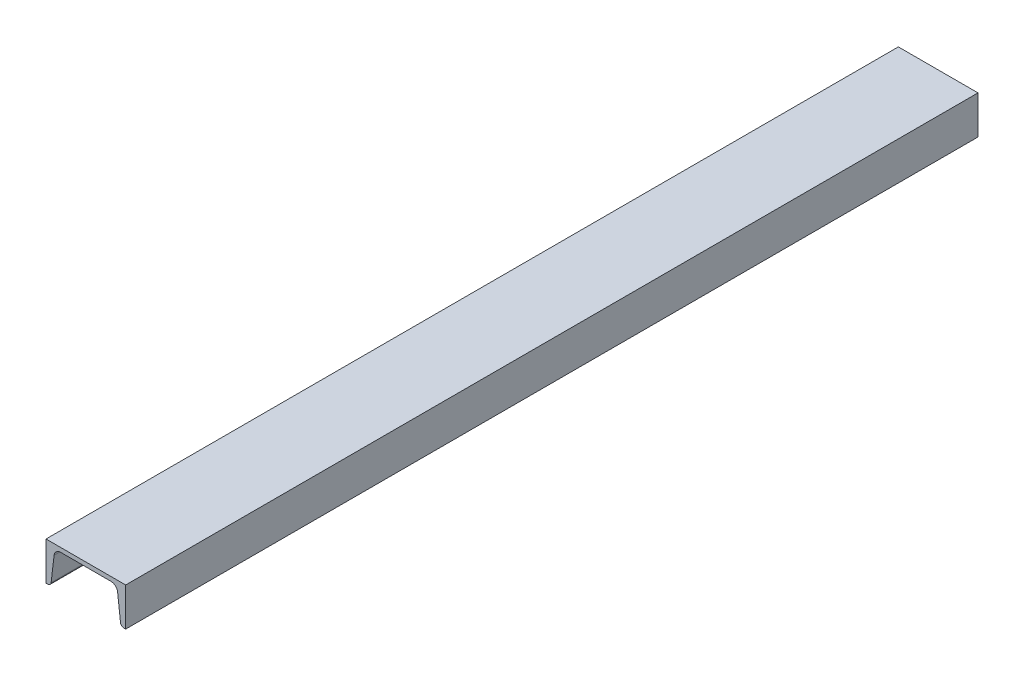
ISO-10303-21;
HEADER;
FILE_DESCRIPTION(('STEP AP214'),'2;1');
FILE_NAME('part.step','',(''),(''),'','','');
FILE_SCHEMA(('AUTOMOTIVE_DESIGN { 1 0 10303 214 1 1 1 1 }'));
ENDSEC;
DATA;
#1=APPLICATION_CONTEXT('core data for automotive mechanical design processes');
#2=APPLICATION_PROTOCOL_DEFINITION('international standard','automotive_design',2000,#1);
#3=PRODUCT_CONTEXT('',#1,'mechanical');
#4=PRODUCT('Part','Part','',(#3));
#5=PRODUCT_RELATED_PRODUCT_CATEGORY('part','',(#4));
#6=PRODUCT_DEFINITION_FORMATION('','',#4);
#7=PRODUCT_DEFINITION_CONTEXT('part definition',#1,'design');
#8=PRODUCT_DEFINITION('design','',#6,#7);
#9=PRODUCT_DEFINITION_SHAPE('','',#8);
#10=(LENGTH_UNIT() NAMED_UNIT(*) SI_UNIT(.MILLI.,.METRE.));
#11=(NAMED_UNIT(*) PLANE_ANGLE_UNIT() SI_UNIT($,.RADIAN.));
#12=(NAMED_UNIT(*) SI_UNIT($,.STERADIAN.) SOLID_ANGLE_UNIT());
#13=UNCERTAINTY_MEASURE_WITH_UNIT(LENGTH_MEASURE(1.E-05),#10,'distance_accuracy_value','');
#14=(GEOMETRIC_REPRESENTATION_CONTEXT(3) GLOBAL_UNCERTAINTY_ASSIGNED_CONTEXT((#13)) GLOBAL_UNIT_ASSIGNED_CONTEXT((#10,
#11,#12)) REPRESENTATION_CONTEXT('',''));
#15=CARTESIAN_POINT('',(0.,0.,0.));
#16=DIRECTION('',(0.,0.,1.));
#17=DIRECTION('',(1.,0.,0.));
#18=AXIS2_PLACEMENT_3D('',#15,#16,#17);
#19=CARTESIAN_POINT('',(-50.,-48.,1070.));
#20=DIRECTION('',(1.,0.,0.));
#21=DIRECTION('',(0.,0.,-1.));
#22=AXIS2_PLACEMENT_3D('',#19,#20,#21);
#23=PLANE('',#22);
#24=DIRECTION('',(0.,-1.,0.));
#25=VECTOR('',#24,1.);
#26=CARTESIAN_POINT('',(-50.,-48.,0.));
#27=LINE('',#26,#25);
#28=CARTESIAN_POINT('',(-50.,0.,0.));
#29=VERTEX_POINT('',#28);
#30=CARTESIAN_POINT('',(-50.,-48.,0.));
#31=VERTEX_POINT('',#30);
#32=EDGE_CURVE('E133',#29,#31,#27,.T.);
#33=ORIENTED_EDGE('',*,*,#32,.T.);
#34=DIRECTION('',(0.,0.,-1.));
#35=VECTOR('',#34,1.);
#36=CARTESIAN_POINT('',(-50.,-48.,1070.));
#37=LINE('',#36,#35);
#38=CARTESIAN_POINT('',(-50.,-48.,1070.));
#39=VERTEX_POINT('',#38);
#40=EDGE_CURVE('E11',#39,#31,#37,.T.);
#41=ORIENTED_EDGE('',*,*,#40,.F.);
#42=DIRECTION('',(0.,-1.,0.));
#43=VECTOR('',#42,1.);
#44=CARTESIAN_POINT('',(-50.,-48.,1070.));
#45=LINE('',#44,#43);
#46=CARTESIAN_POINT('',(-50.,0.,1070.));
#47=VERTEX_POINT('',#46);
#48=EDGE_CURVE('E168',#47,#39,#45,.T.);
#49=ORIENTED_EDGE('',*,*,#48,.F.);
#50=DIRECTION('',(0.,0.,-1.));
#51=VECTOR('',#50,1.);
#52=CARTESIAN_POINT('',(-50.,0.,1070.));
#53=LINE('',#52,#51);
#54=EDGE_CURVE('E146',#47,#29,#53,.T.);
#55=ORIENTED_EDGE('',*,*,#54,.T.);
#56=EDGE_LOOP('',(#33,#41,#49,#55));
#57=FACE_BOUND('',#56,.T.);
#58=ADVANCED_FACE('F41',(#57),#23,.F.);
#59=CARTESIAN_POINT('',(-47.8258664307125,-48.,1070.));
#60=DIRECTION('',(0.,1.,0.));
#61=DIRECTION('',(0.,0.,1.));
#62=AXIS2_PLACEMENT_3D('',#59,#60,#61);
#63=PLANE('',#62);
#64=DIRECTION('',(1.,0.,0.));
#65=VECTOR('',#64,1.);
#66=CARTESIAN_POINT('',(-47.8258664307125,-48.,0.));
#67=LINE('',#66,#65);
#68=CARTESIAN_POINT('',(-47.8258664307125,-48.,0.));
#69=VERTEX_POINT('',#68);
#70=EDGE_CURVE('E129',#31,#69,#67,.T.);
#71=ORIENTED_EDGE('',*,*,#70,.T.);
#72=DIRECTION('',(0.,0.,-1.));
#73=VECTOR('',#72,1.);
#74=CARTESIAN_POINT('',(-47.8258664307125,-48.,1070.));
#75=LINE('',#74,#73);
#76=CARTESIAN_POINT('',(-47.8258664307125,-48.,1070.));
#77=VERTEX_POINT('',#76);
#78=EDGE_CURVE('E48',#77,#69,#75,.T.);
#79=ORIENTED_EDGE('',*,*,#78,.F.);
#80=DIRECTION('',(1.,0.,0.));
#81=VECTOR('',#80,1.);
#82=CARTESIAN_POINT('',(-47.8258664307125,-48.,1070.));
#83=LINE('',#82,#81);
#84=EDGE_CURVE('E142',#39,#77,#83,.T.);
#85=ORIENTED_EDGE('',*,*,#84,.F.);
#86=ORIENTED_EDGE('',*,*,#40,.T.);
#87=EDGE_LOOP('',(#71,#79,#85,#86));
#88=FACE_BOUND('',#87,.T.);
#89=ADVANCED_FACE('F141',(#88),#63,.F.);
#90=CARTESIAN_POINT('',(-47.8258664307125,-43.7,1070.));
#91=DIRECTION('',(0.,0.,-1.));
#92=DIRECTION('',(-1.,0.,0.));
#93=AXIS2_PLACEMENT_3D('',#90,#91,#92);
#94=CYLINDRICAL_SURFACE('',#93,4.3);
#95=CARTESIAN_POINT('',(-47.8258664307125,-43.7,0.));
#96=DIRECTION('',(0.,0.,1.));
#97=DIRECTION('',(-1.,0.,0.));
#98=AXIS2_PLACEMENT_3D('',#95,#96,#97);
#99=CIRCLE('',#98,4.3);
#100=CARTESIAN_POINT('',(-43.5550463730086,-44.2000960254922,0.));
#101=VERTEX_POINT('',#100);
#102=EDGE_CURVE('E135',#69,#101,#99,.T.);
#103=ORIENTED_EDGE('',*,*,#102,.T.);
#104=DIRECTION('',(0.,0.,-1.));
#105=VECTOR('',#104,1.);
#106=CARTESIAN_POINT('',(-43.5550463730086,-44.2000960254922,1070.));
#107=LINE('',#106,#105);
#108=CARTESIAN_POINT('',(-43.5550463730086,-44.2000960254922,1070.));
#109=VERTEX_POINT('',#108);
#110=EDGE_CURVE('E214',#109,#101,#107,.T.);
#111=ORIENTED_EDGE('',*,*,#110,.F.);
#112=CARTESIAN_POINT('',(-47.8258664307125,-43.7,1070.));
#113=DIRECTION('',(0.,0.,1.));
#114=DIRECTION('',(-1.,0.,0.));
#115=AXIS2_PLACEMENT_3D('',#112,#113,#114);
#116=CIRCLE('',#115,4.3);
#117=EDGE_CURVE('E171',#77,#109,#116,.T.);
#118=ORIENTED_EDGE('',*,*,#117,.F.);
#119=ORIENTED_EDGE('',*,*,#78,.T.);
#120=EDGE_LOOP('',(#103,#111,#118,#119));
#121=FACE_BOUND('',#120,.T.);
#122=ADVANCED_FACE('F218',(#121),#94,.T.);
#123=CARTESIAN_POINT('',(-39.8795594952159,-12.8114380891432,1070.));
#124=DIRECTION('',(-0.993213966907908,0.116301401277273,0.));
#125=DIRECTION('',(-0.116301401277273,-0.993213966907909,0.));
#126=AXIS2_PLACEMENT_3D('',#123,#124,#125);
#127=PLANE('',#126);
#128=DIRECTION('',(0.116301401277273,0.993213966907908,0.));
#129=VECTOR('',#128,1.);
#130=CARTESIAN_POINT('',(-39.8795594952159,-12.8114380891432,0.));
#131=LINE('',#130,#129);
#132=CARTESIAN_POINT('',(-39.8795594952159,-12.8114380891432,0.));
#133=VERTEX_POINT('',#132);
#134=EDGE_CURVE('E150',#101,#133,#131,.T.);
#135=ORIENTED_EDGE('',*,*,#134,.T.);
#136=DIRECTION('',(0.,0.,-1.));
#137=VECTOR('',#136,1.);
#138=CARTESIAN_POINT('',(-39.8795594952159,-12.8114380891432,1070.));
#139=LINE('',#138,#137);
#140=CARTESIAN_POINT('',(-39.8795594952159,-12.8114380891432,1070.));
#141=VERTEX_POINT('',#140);
#142=EDGE_CURVE('E211',#141,#133,#139,.T.);
#143=ORIENTED_EDGE('',*,*,#142,.F.);
#144=DIRECTION('',(0.116301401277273,0.993213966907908,0.));
#145=VECTOR('',#144,1.);
#146=CARTESIAN_POINT('',(-39.8795594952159,-12.8114380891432,1070.));
#147=LINE('',#146,#145);
#148=EDGE_CURVE('E173',#109,#141,#147,.T.);
#149=ORIENTED_EDGE('',*,*,#148,.F.);
#150=ORIENTED_EDGE('',*,*,#110,.T.);
#151=EDGE_LOOP('',(#135,#143,#149,#150));
#152=FACE_BOUND('',#151,.T.);
#153=ADVANCED_FACE('F226',(#152),#127,.F.);
#154=CARTESIAN_POINT('',(-31.4372407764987,-13.8,1070.));
#155=DIRECTION('',(0.,0.,-1.));
#156=DIRECTION('',(-1.,0.,0.));
#157=AXIS2_PLACEMENT_3D('',#154,#155,#156);
#158=CYLINDRICAL_SURFACE('',#157,8.5);
#159=CARTESIAN_POINT('',(-31.4372407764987,-13.8,0.));
#160=DIRECTION('',(0.,0.,-1.));
#161=DIRECTION('',(1.,0.,0.));
#162=AXIS2_PLACEMENT_3D('',#159,#160,#161);
#163=CIRCLE('',#162,8.5);
#164=CARTESIAN_POINT('',(-31.4372407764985,-5.29999999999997,0.));
#165=VERTEX_POINT('',#164);
#166=EDGE_CURVE('E152',#133,#165,#163,.T.);
#167=ORIENTED_EDGE('',*,*,#166,.T.);
#168=DIRECTION('',(0.,0.,-1.));
#169=VECTOR('',#168,1.);
#170=CARTESIAN_POINT('',(-31.4372407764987,-5.29999999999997,1070.));
#171=LINE('',#170,#169);
#172=CARTESIAN_POINT('',(-31.4372407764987,-5.29999999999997,1070.));
#173=VERTEX_POINT('',#172);
#174=EDGE_CURVE('E208',#173,#165,#171,.T.);
#175=ORIENTED_EDGE('',*,*,#174,.F.);
#176=CARTESIAN_POINT('',(-31.4372407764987,-13.8,1070.));
#177=DIRECTION('',(0.,0.,-1.));
#178=DIRECTION('',(1.,0.,0.));
#179=AXIS2_PLACEMENT_3D('',#176,#177,#178);
#180=CIRCLE('',#179,8.5);
#181=EDGE_CURVE('E175',#141,#173,#180,.T.);
#182=ORIENTED_EDGE('',*,*,#181,.F.);
#183=ORIENTED_EDGE('',*,*,#142,.T.);
#184=EDGE_LOOP('',(#167,#175,#182,#183));
#185=FACE_BOUND('',#184,.T.);
#186=ADVANCED_FACE('F229',(#185),#158,.F.);
#187=CARTESIAN_POINT('',(31.4372407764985,-5.29999999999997,1070.));
#188=DIRECTION('',(0.,1.,0.));
#189=DIRECTION('',(-1.,0.,0.));
#190=AXIS2_PLACEMENT_3D('',#187,#188,#189);
#191=PLANE('',#190);
#192=DIRECTION('',(1.,0.,0.));
#193=VECTOR('',#192,1.);
#194=CARTESIAN_POINT('',(31.4372407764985,-5.3,0.));
#195=LINE('',#194,#193);
#196=CARTESIAN_POINT('',(31.4372407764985,-5.3,0.));
#197=VERTEX_POINT('',#196);
#198=EDGE_CURVE('E154',#165,#197,#195,.T.);
#199=ORIENTED_EDGE('',*,*,#198,.T.);
#200=DIRECTION('',(0.,0.,-1.));
#201=VECTOR('',#200,1.);
#202=CARTESIAN_POINT('',(31.4372407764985,-5.29999999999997,1070.));
#203=LINE('',#202,#201);
#204=CARTESIAN_POINT('',(31.4372407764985,-5.29999999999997,1070.));
#205=VERTEX_POINT('',#204);
#206=EDGE_CURVE('E205',#205,#197,#203,.T.);
#207=ORIENTED_EDGE('',*,*,#206,.F.);
#208=DIRECTION('',(1.,0.,0.));
#209=VECTOR('',#208,1.);
#210=CARTESIAN_POINT('',(31.4372407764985,-5.29999999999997,1070.));
#211=LINE('',#210,#209);
#212=EDGE_CURVE('E177',#173,#205,#211,.T.);
#213=ORIENTED_EDGE('',*,*,#212,.F.);
#214=ORIENTED_EDGE('',*,*,#174,.T.);
#215=EDGE_LOOP('',(#199,#207,#213,#214));
#216=FACE_BOUND('',#215,.T.);
#217=ADVANCED_FACE('F234',(#216),#191,.F.);
#218=CARTESIAN_POINT('',(31.4372407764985,-13.8,1070.));
#219=DIRECTION('',(0.,0.,-1.));
#220=DIRECTION('',(-1.,0.,0.));
#221=AXIS2_PLACEMENT_3D('',#218,#219,#220);
#222=CYLINDRICAL_SURFACE('',#221,8.5);
#223=CARTESIAN_POINT('',(31.4372407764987,-13.8,0.));
#224=DIRECTION('',(0.,0.,-1.));
#225=DIRECTION('',(1.,0.,0.));
#226=AXIS2_PLACEMENT_3D('',#223,#224,#225);
#227=CIRCLE('',#226,8.5);
#228=CARTESIAN_POINT('',(39.8795594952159,-12.8114380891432,0.));
#229=VERTEX_POINT('',#228);
#230=EDGE_CURVE('E156',#197,#229,#227,.T.);
#231=ORIENTED_EDGE('',*,*,#230,.T.);
#232=DIRECTION('',(0.,0.,-1.));
#233=VECTOR('',#232,1.);
#234=CARTESIAN_POINT('',(39.8795594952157,-12.8114380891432,1070.));
#235=LINE('',#234,#233);
#236=CARTESIAN_POINT('',(39.8795594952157,-12.8114380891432,1070.));
#237=VERTEX_POINT('',#236);
#238=EDGE_CURVE('E202',#237,#229,#235,.T.);
#239=ORIENTED_EDGE('',*,*,#238,.F.);
#240=CARTESIAN_POINT('',(31.4372407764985,-13.8,1070.));
#241=DIRECTION('',(0.,0.,-1.));
#242=DIRECTION('',(1.,0.,0.));
#243=AXIS2_PLACEMENT_3D('',#240,#241,#242);
#244=CIRCLE('',#243,8.5);
#245=EDGE_CURVE('E179',#205,#237,#244,.T.);
#246=ORIENTED_EDGE('',*,*,#245,.F.);
#247=ORIENTED_EDGE('',*,*,#206,.T.);
#248=EDGE_LOOP('',(#231,#239,#246,#247));
#249=FACE_BOUND('',#248,.T.);
#250=ADVANCED_FACE('F240',(#249),#222,.F.);
#251=CARTESIAN_POINT('',(43.5550463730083,-44.2000960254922,1070.));
#252=DIRECTION('',(0.993213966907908,0.116301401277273,0.));
#253=DIRECTION('',(-0.116301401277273,0.993213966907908,0.));
#254=AXIS2_PLACEMENT_3D('',#251,#252,#253);
#255=PLANE('',#254);
#256=DIRECTION('',(0.116301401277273,-0.993213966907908,0.));
#257=VECTOR('',#256,1.);
#258=CARTESIAN_POINT('',(43.5550463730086,-44.2000960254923,0.));
#259=LINE('',#258,#257);
#260=CARTESIAN_POINT('',(43.5550463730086,-44.2000960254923,0.));
#261=VERTEX_POINT('',#260);
#262=EDGE_CURVE('E158',#229,#261,#259,.T.);
#263=ORIENTED_EDGE('',*,*,#262,.T.);
#264=DIRECTION('',(0.,0.,-1.));
#265=VECTOR('',#264,1.);
#266=CARTESIAN_POINT('',(43.5550463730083,-44.2000960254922,1070.));
#267=LINE('',#266,#265);
#268=CARTESIAN_POINT('',(43.5550463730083,-44.2000960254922,1070.));
#269=VERTEX_POINT('',#268);
#270=EDGE_CURVE('E199',#269,#261,#267,.T.);
#271=ORIENTED_EDGE('',*,*,#270,.F.);
#272=DIRECTION('',(0.116301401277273,-0.993213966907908,0.));
#273=VECTOR('',#272,1.);
#274=CARTESIAN_POINT('',(43.5550463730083,-44.2000960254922,1070.));
#275=LINE('',#274,#273);
#276=EDGE_CURVE('E181',#237,#269,#275,.T.);
#277=ORIENTED_EDGE('',*,*,#276,.F.);
#278=ORIENTED_EDGE('',*,*,#238,.T.);
#279=EDGE_LOOP('',(#263,#271,#277,#278));
#280=FACE_BOUND('',#279,.T.);
#281=ADVANCED_FACE('F244',(#280),#255,.F.);
#282=CARTESIAN_POINT('',(47.8258664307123,-43.7,1070.));
#283=DIRECTION('',(0.,0.,-1.));
#284=DIRECTION('',(-1.,0.,0.));
#285=AXIS2_PLACEMENT_3D('',#282,#283,#284);
#286=CYLINDRICAL_SURFACE('',#285,4.3);
#287=CARTESIAN_POINT('',(47.8258664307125,-43.7,0.));
#288=DIRECTION('',(0.,0.,1.));
#289=DIRECTION('',(-1.,0.,0.));
#290=AXIS2_PLACEMENT_3D('',#287,#288,#289);
#291=CIRCLE('',#290,4.3);
#292=CARTESIAN_POINT('',(47.8258664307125,-48.,0.));
#293=VERTEX_POINT('',#292);
#294=EDGE_CURVE('E160',#261,#293,#291,.T.);
#295=ORIENTED_EDGE('',*,*,#294,.T.);
#296=DIRECTION('',(0.,0.,-1.));
#297=VECTOR('',#296,1.);
#298=CARTESIAN_POINT('',(47.8258664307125,-48.,1070.));
#299=LINE('',#298,#297);
#300=CARTESIAN_POINT('',(47.8258664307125,-48.,1070.));
#301=VERTEX_POINT('',#300);
#302=EDGE_CURVE('E196',#301,#293,#299,.T.);
#303=ORIENTED_EDGE('',*,*,#302,.F.);
#304=CARTESIAN_POINT('',(47.8258664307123,-43.7,1070.));
#305=DIRECTION('',(0.,0.,1.));
#306=DIRECTION('',(-1.,0.,0.));
#307=AXIS2_PLACEMENT_3D('',#304,#305,#306);
#308=CIRCLE('',#307,4.3);
#309=EDGE_CURVE('E183',#269,#301,#308,.T.);
#310=ORIENTED_EDGE('',*,*,#309,.F.);
#311=ORIENTED_EDGE('',*,*,#270,.T.);
#312=EDGE_LOOP('',(#295,#303,#310,#311));
#313=FACE_BOUND('',#312,.T.);
#314=ADVANCED_FACE('F249',(#313),#286,.T.);
#315=CARTESIAN_POINT('',(49.9999999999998,-48.,1070.));
#316=DIRECTION('',(0.,1.,0.));
#317=DIRECTION('',(0.,0.,1.));
#318=AXIS2_PLACEMENT_3D('',#315,#316,#317);
#319=PLANE('',#318);
#320=DIRECTION('',(1.,0.,0.));
#321=VECTOR('',#320,1.);
#322=CARTESIAN_POINT('',(50.,-48.,0.));
#323=LINE('',#322,#321);
#324=CARTESIAN_POINT('',(50.,-48.,0.));
#325=VERTEX_POINT('',#324);
#326=EDGE_CURVE('E162',#293,#325,#323,.T.);
#327=ORIENTED_EDGE('',*,*,#326,.T.);
#328=DIRECTION('',(0.,0.,-1.));
#329=VECTOR('',#328,1.);
#330=CARTESIAN_POINT('',(49.9999999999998,-48.,1070.));
#331=LINE('',#330,#329);
#332=CARTESIAN_POINT('',(49.9999999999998,-48.,1070.));
#333=VERTEX_POINT('',#332);
#334=EDGE_CURVE('E193',#333,#325,#331,.T.);
#335=ORIENTED_EDGE('',*,*,#334,.F.);
#336=DIRECTION('',(1.,0.,0.));
#337=VECTOR('',#336,1.);
#338=CARTESIAN_POINT('',(49.9999999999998,-48.,1070.));
#339=LINE('',#338,#337);
#340=EDGE_CURVE('E185',#301,#333,#339,.T.);
#341=ORIENTED_EDGE('',*,*,#340,.F.);
#342=ORIENTED_EDGE('',*,*,#302,.T.);
#343=EDGE_LOOP('',(#327,#335,#341,#342));
#344=FACE_BOUND('',#343,.T.);
#345=ADVANCED_FACE('F253',(#344),#319,.F.);
#346=CARTESIAN_POINT('',(49.9999999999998,0.,1070.));
#347=DIRECTION('',(-1.,0.,0.));
#348=DIRECTION('',(0.,-1.,0.));
#349=AXIS2_PLACEMENT_3D('',#346,#347,#348);
#350=PLANE('',#349);
#351=DIRECTION('',(0.,1.,0.));
#352=VECTOR('',#351,1.);
#353=CARTESIAN_POINT('',(50.,0.,0.));
#354=LINE('',#353,#352);
#355=CARTESIAN_POINT('',(50.,0.,0.));
#356=VERTEX_POINT('',#355);
#357=EDGE_CURVE('E164',#325,#356,#354,.T.);
#358=ORIENTED_EDGE('',*,*,#357,.T.);
#359=DIRECTION('',(0.,0.,-1.));
#360=VECTOR('',#359,1.);
#361=CARTESIAN_POINT('',(49.9999999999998,0.,1070.));
#362=LINE('',#361,#360);
#363=CARTESIAN_POINT('',(49.9999999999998,0.,1070.));
#364=VERTEX_POINT('',#363);
#365=EDGE_CURVE('E190',#364,#356,#362,.T.);
#366=ORIENTED_EDGE('',*,*,#365,.F.);
#367=DIRECTION('',(0.,1.,0.));
#368=VECTOR('',#367,1.);
#369=CARTESIAN_POINT('',(49.9999999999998,0.,1070.));
#370=LINE('',#369,#368);
#371=EDGE_CURVE('E60',#333,#364,#370,.T.);
#372=ORIENTED_EDGE('',*,*,#371,.F.);
#373=ORIENTED_EDGE('',*,*,#334,.T.);
#374=EDGE_LOOP('',(#358,#366,#372,#373));
#375=FACE_BOUND('',#374,.T.);
#376=ADVANCED_FACE('F257',(#375),#350,.F.);
#377=CARTESIAN_POINT('',(-50.,0.,1070.));
#378=DIRECTION('',(0.,-1.,0.));
#379=DIRECTION('',(0.,0.,-1.));
#380=AXIS2_PLACEMENT_3D('',#377,#378,#379);
#381=PLANE('',#380);
#382=DIRECTION('',(-1.,0.,0.));
#383=VECTOR('',#382,1.);
#384=CARTESIAN_POINT('',(-50.,0.,0.));
#385=LINE('',#384,#383);
#386=EDGE_CURVE('E166',#356,#29,#385,.T.);
#387=ORIENTED_EDGE('',*,*,#386,.T.);
#388=ORIENTED_EDGE('',*,*,#54,.F.);
#389=DIRECTION('',(-1.,0.,0.));
#390=VECTOR('',#389,1.);
#391=CARTESIAN_POINT('',(-50.,0.,1070.));
#392=LINE('',#391,#390);
#393=EDGE_CURVE('E55',#364,#47,#392,.T.);
#394=ORIENTED_EDGE('',*,*,#393,.F.);
#395=ORIENTED_EDGE('',*,*,#365,.T.);
#396=EDGE_LOOP('',(#387,#388,#394,#395));
#397=FACE_BOUND('',#396,.T.);
#398=ADVANCED_FACE('F259',(#397),#381,.F.);
#399=CARTESIAN_POINT('',(47.8258664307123,-43.7,1070.));
#400=DIRECTION('',(0.,0.,-1.));
#401=DIRECTION('',(-1.,0.,0.));
#402=AXIS2_PLACEMENT_3D('',#399,#400,#401);
#403=PLANE('',#402);
#404=ORIENTED_EDGE('',*,*,#48,.T.);
#405=ORIENTED_EDGE('',*,*,#84,.T.);
#406=ORIENTED_EDGE('',*,*,#117,.T.);
#407=ORIENTED_EDGE('',*,*,#148,.T.);
#408=ORIENTED_EDGE('',*,*,#181,.T.);
#409=ORIENTED_EDGE('',*,*,#212,.T.);
#410=ORIENTED_EDGE('',*,*,#245,.T.);
#411=ORIENTED_EDGE('',*,*,#276,.T.);
#412=ORIENTED_EDGE('',*,*,#309,.T.);
#413=ORIENTED_EDGE('',*,*,#340,.T.);
#414=ORIENTED_EDGE('',*,*,#371,.T.);
#415=ORIENTED_EDGE('',*,*,#393,.T.);
#416=EDGE_LOOP('',(#404,#405,#406,#407,#408,#409,#410,#411,#412,#413,#414,#415));
#417=FACE_BOUND('',#416,.T.);
#418=ADVANCED_FACE('F221',(#417),#403,.F.);
#419=CARTESIAN_POINT('',(47.8258664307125,-43.7,0.));
#420=DIRECTION('',(0.,0.,-1.));
#421=DIRECTION('',(-1.,0.,0.));
#422=AXIS2_PLACEMENT_3D('',#419,#420,#421);
#423=PLANE('',#422);
#424=ORIENTED_EDGE('',*,*,#32,.F.);
#425=ORIENTED_EDGE('',*,*,#386,.F.);
#426=ORIENTED_EDGE('',*,*,#357,.F.);
#427=ORIENTED_EDGE('',*,*,#326,.F.);
#428=ORIENTED_EDGE('',*,*,#294,.F.);
#429=ORIENTED_EDGE('',*,*,#262,.F.);
#430=ORIENTED_EDGE('',*,*,#230,.F.);
#431=ORIENTED_EDGE('',*,*,#198,.F.);
#432=ORIENTED_EDGE('',*,*,#166,.F.);
#433=ORIENTED_EDGE('',*,*,#134,.F.);
#434=ORIENTED_EDGE('',*,*,#102,.F.);
#435=ORIENTED_EDGE('',*,*,#70,.F.);
#436=EDGE_LOOP('',(#424,#425,#426,#427,#428,#429,#430,#431,#432,#433,#434,#435));
#437=FACE_BOUND('',#436,.T.);
#438=ADVANCED_FACE('F130',(#437),#423,.T.);
#439=CLOSED_SHELL('',(#58,#89,#122,#153,#186,#217,#250,#281,#314,#345,#376,#398,#418,#438));
#440=MANIFOLD_SOLID_BREP('B2',#439);
#441=ADVANCED_BREP_SHAPE_REPRESENTATION('',(#18,#440),#14);
#442=SHAPE_DEFINITION_REPRESENTATION(#9,#441);
ENDSEC;
END-ISO-10303-21;
